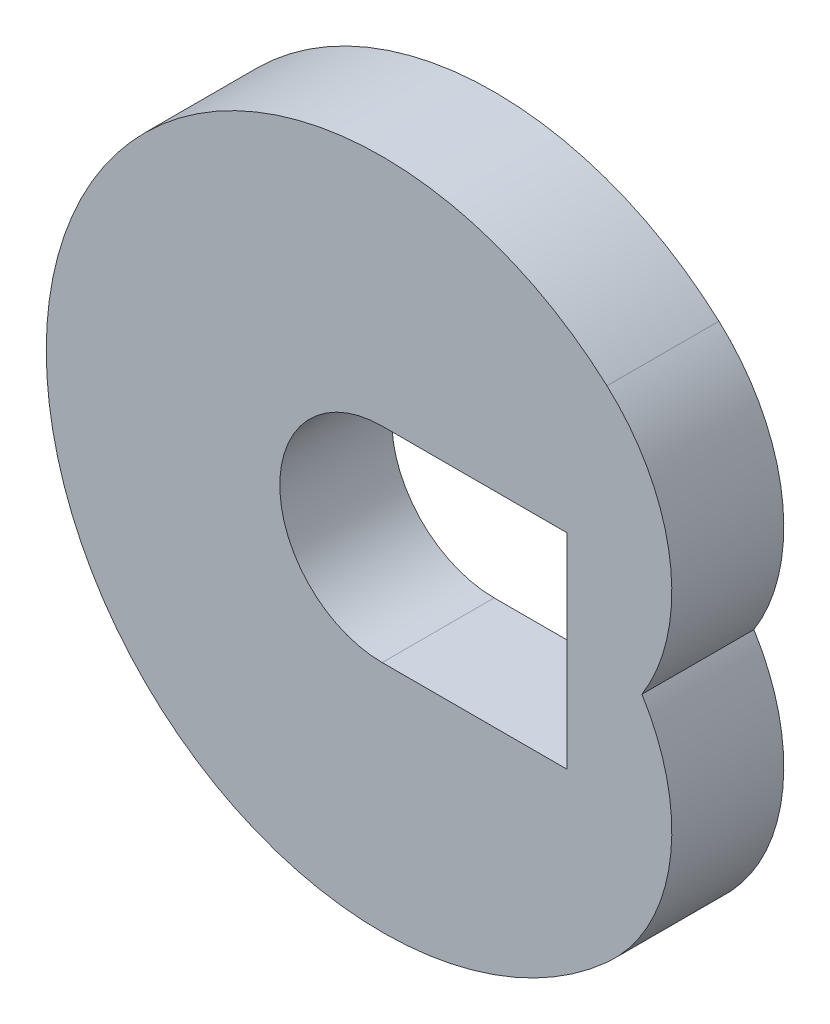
ISO-10303-21;
HEADER;
FILE_DESCRIPTION(('STEP AP214'),'2;1');
FILE_NAME('part.step','',(''),(''),'','','');
FILE_SCHEMA(('AUTOMOTIVE_DESIGN { 1 0 10303 214 1 1 1 1 }'));
ENDSEC;
DATA;
#1=APPLICATION_CONTEXT('core data for automotive mechanical design processes');
#2=APPLICATION_PROTOCOL_DEFINITION('international standard','automotive_design',2000,#1);
#3=PRODUCT_CONTEXT('',#1,'mechanical');
#4=PRODUCT('Part','Part','',(#3));
#5=PRODUCT_RELATED_PRODUCT_CATEGORY('part','',(#4));
#6=PRODUCT_DEFINITION_FORMATION('','',#4);
#7=PRODUCT_DEFINITION_CONTEXT('part definition',#1,'design');
#8=PRODUCT_DEFINITION('design','',#6,#7);
#9=PRODUCT_DEFINITION_SHAPE('','',#8);
#10=(LENGTH_UNIT() NAMED_UNIT(*) SI_UNIT(.MILLI.,.METRE.));
#11=(NAMED_UNIT(*) PLANE_ANGLE_UNIT() SI_UNIT($,.RADIAN.));
#12=(NAMED_UNIT(*) SI_UNIT($,.STERADIAN.) SOLID_ANGLE_UNIT());
#13=UNCERTAINTY_MEASURE_WITH_UNIT(LENGTH_MEASURE(1.E-05),#10,'distance_accuracy_value','');
#14=(GEOMETRIC_REPRESENTATION_CONTEXT(3) GLOBAL_UNCERTAINTY_ASSIGNED_CONTEXT((#13)) GLOBAL_UNIT_ASSIGNED_CONTEXT((#10,
#11,#12)) REPRESENTATION_CONTEXT('',''));
#15=CARTESIAN_POINT('',(0.,0.,0.));
#16=DIRECTION('',(0.,0.,1.));
#17=DIRECTION('',(1.,0.,0.));
#18=AXIS2_PLACEMENT_3D('',#15,#16,#17);
#19=CARTESIAN_POINT('',(167.282651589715,0.,200.));
#20=DIRECTION('',(0.,0.,-1.));
#21=DIRECTION('',(-1.,0.,0.));
#22=AXIS2_PLACEMENT_3D('',#19,#20,#21);
#23=PLANE('',#22);
#24=CARTESIAN_POINT('',(167.282651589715,185.786206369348,200.));
#25=DIRECTION('',(0.,0.,-1.));
#26=DIRECTION('',(-1.,0.,0.));
#27=AXIS2_PLACEMENT_3D('',#24,#25,#26);
#28=CIRCLE('',#27,350.);
#29=CARTESIAN_POINT('',(401.478363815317,445.886895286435,200.));
#30=VERTEX_POINT('',#29);
#31=CARTESIAN_POINT('',(463.902754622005,1.11022302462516E-13,200.));
#32=VERTEX_POINT('',#31);
#33=EDGE_CURVE('E154',#30,#32,#28,.T.);
#34=ORIENTED_EDGE('',*,*,#33,.F.);
#35=CARTESIAN_POINT('',(0.,0.,200.));
#36=DIRECTION('',(0.,0.,1.));
#37=DIRECTION('',(1.,0.,0.));
#38=AXIS2_PLACEMENT_3D('',#35,#36,#37);
#39=CIRCLE('',#38,600.);
#40=CARTESIAN_POINT('',(401.478363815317,-445.886895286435,200.));
#41=VERTEX_POINT('',#40);
#42=EDGE_CURVE('E160',#30,#41,#39,.T.);
#43=ORIENTED_EDGE('',*,*,#42,.T.);
#44=CARTESIAN_POINT('',(167.282651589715,-185.786206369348,200.));
#45=DIRECTION('',(0.,0.,1.));
#46=DIRECTION('',(1.,0.,0.));
#47=AXIS2_PLACEMENT_3D('',#44,#45,#46);
#48=CIRCLE('',#47,350.);
#49=EDGE_CURVE('E157',#41,#32,#48,.T.);
#50=ORIENTED_EDGE('',*,*,#49,.T.);
#51=EDGE_LOOP('',(#34,#43,#50));
#52=FACE_BOUND('',#51,.T.);
#53=CARTESIAN_POINT('',(0.,0.,200.));
#54=DIRECTION('',(0.,0.,1.));
#55=DIRECTION('',(1.,0.,0.));
#56=AXIS2_PLACEMENT_3D('',#53,#54,#55);
#57=CIRCLE('',#56,182.881257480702);
#58=CARTESIAN_POINT('',(0.,182.881257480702,200.));
#59=VERTEX_POINT('',#58);
#60=CARTESIAN_POINT('',(0.,-182.881257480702,200.));
#61=VERTEX_POINT('',#60);
#62=EDGE_CURVE('E117',#59,#61,#57,.T.);
#63=ORIENTED_EDGE('',*,*,#62,.F.);
#64=DIRECTION('',(1.,0.,0.));
#65=VECTOR('',#64,1.);
#66=CARTESIAN_POINT('',(0.,182.881257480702,200.));
#67=LINE('',#66,#65);
#68=CARTESIAN_POINT('',(330.,182.881257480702,200.));
#69=VERTEX_POINT('',#68);
#70=EDGE_CURVE('E139',#59,#69,#67,.T.);
#71=ORIENTED_EDGE('',*,*,#70,.T.);
#72=DIRECTION('',(0.,-1.,0.));
#73=VECTOR('',#72,1.);
#74=CARTESIAN_POINT('',(330.,182.881257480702,200.));
#75=LINE('',#74,#73);
#76=CARTESIAN_POINT('',(330.,-182.881257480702,200.));
#77=VERTEX_POINT('',#76);
#78=EDGE_CURVE('E76',#69,#77,#75,.T.);
#79=ORIENTED_EDGE('',*,*,#78,.T.);
#80=DIRECTION('',(-1.,0.,0.));
#81=VECTOR('',#80,1.);
#82=CARTESIAN_POINT('',(330.,-182.881257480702,200.));
#83=LINE('',#82,#81);
#84=EDGE_CURVE('E127',#77,#61,#83,.T.);
#85=ORIENTED_EDGE('',*,*,#84,.T.);
#86=EDGE_LOOP('',(#63,#71,#79,#85));
#87=FACE_BOUND('',#86,.T.);
#88=ADVANCED_FACE('F59',(#52,#87),#23,.F.);
#89=CARTESIAN_POINT('',(167.282651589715,0.,0.));
#90=DIRECTION('',(0.,0.,-1.));
#91=DIRECTION('',(-1.,0.,0.));
#92=AXIS2_PLACEMENT_3D('',#89,#90,#91);
#93=PLANE('',#92);
#94=CARTESIAN_POINT('',(167.282651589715,185.786206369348,0.));
#95=DIRECTION('',(0.,0.,-1.));
#96=DIRECTION('',(-1.,0.,0.));
#97=AXIS2_PLACEMENT_3D('',#94,#95,#96);
#98=CIRCLE('',#97,350.);
#99=CARTESIAN_POINT('',(401.478363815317,445.886895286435,0.));
#100=VERTEX_POINT('',#99);
#101=CARTESIAN_POINT('',(463.902754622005,1.11022302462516E-13,0.));
#102=VERTEX_POINT('',#101);
#103=EDGE_CURVE('E135',#100,#102,#98,.T.);
#104=ORIENTED_EDGE('',*,*,#103,.T.);
#105=CARTESIAN_POINT('',(167.282651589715,-185.786206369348,0.));
#106=DIRECTION('',(0.,0.,1.));
#107=DIRECTION('',(1.,0.,0.));
#108=AXIS2_PLACEMENT_3D('',#105,#106,#107);
#109=CIRCLE('',#108,350.);
#110=CARTESIAN_POINT('',(401.478363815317,-445.886895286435,0.));
#111=VERTEX_POINT('',#110);
#112=EDGE_CURVE('E164',#111,#102,#109,.T.);
#113=ORIENTED_EDGE('',*,*,#112,.F.);
#114=CARTESIAN_POINT('',(0.,0.,0.));
#115=DIRECTION('',(0.,0.,1.));
#116=DIRECTION('',(1.,0.,0.));
#117=AXIS2_PLACEMENT_3D('',#114,#115,#116);
#118=CIRCLE('',#117,600.);
#119=EDGE_CURVE('E158',#100,#111,#118,.T.);
#120=ORIENTED_EDGE('',*,*,#119,.F.);
#121=EDGE_LOOP('',(#104,#113,#120));
#122=FACE_BOUND('',#121,.T.);
#123=DIRECTION('',(1.,0.,0.));
#124=VECTOR('',#123,1.);
#125=CARTESIAN_POINT('',(0.,182.881257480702,0.));
#126=LINE('',#125,#124);
#127=CARTESIAN_POINT('',(0.,182.881257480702,0.));
#128=VERTEX_POINT('',#127);
#129=CARTESIAN_POINT('',(330.,182.881257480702,0.));
#130=VERTEX_POINT('',#129);
#131=EDGE_CURVE('E128',#128,#130,#126,.T.);
#132=ORIENTED_EDGE('',*,*,#131,.F.);
#133=CARTESIAN_POINT('',(0.,0.,0.));
#134=DIRECTION('',(0.,0.,1.));
#135=DIRECTION('',(1.,0.,0.));
#136=AXIS2_PLACEMENT_3D('',#133,#134,#135);
#137=CIRCLE('',#136,182.881257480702);
#138=CARTESIAN_POINT('',(0.,-182.881257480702,0.));
#139=VERTEX_POINT('',#138);
#140=EDGE_CURVE('E84',#128,#139,#137,.T.);
#141=ORIENTED_EDGE('',*,*,#140,.T.);
#142=DIRECTION('',(-1.,0.,0.));
#143=VECTOR('',#142,1.);
#144=CARTESIAN_POINT('',(330.,-182.881257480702,0.));
#145=LINE('',#144,#143);
#146=CARTESIAN_POINT('',(330.,-182.881257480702,0.));
#147=VERTEX_POINT('',#146);
#148=EDGE_CURVE('E134',#147,#139,#145,.T.);
#149=ORIENTED_EDGE('',*,*,#148,.F.);
#150=DIRECTION('',(0.,-1.,0.));
#151=VECTOR('',#150,1.);
#152=CARTESIAN_POINT('',(330.,182.881257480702,0.));
#153=LINE('',#152,#151);
#154=EDGE_CURVE('E145',#130,#147,#153,.T.);
#155=ORIENTED_EDGE('',*,*,#154,.F.);
#156=EDGE_LOOP('',(#132,#141,#149,#155));
#157=FACE_BOUND('',#156,.T.);
#158=ADVANCED_FACE('F179',(#122,#157),#93,.T.);
#159=CARTESIAN_POINT('',(167.282651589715,185.786206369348,200.));
#160=DIRECTION('',(0.,0.,-1.));
#161=DIRECTION('',(-1.,0.,0.));
#162=AXIS2_PLACEMENT_3D('',#159,#160,#161);
#163=CYLINDRICAL_SURFACE('',#162,350.);
#164=ORIENTED_EDGE('',*,*,#103,.F.);
#165=DIRECTION('',(0.,0.,-1.));
#166=VECTOR('',#165,1.);
#167=CARTESIAN_POINT('',(401.478363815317,445.886895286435,200.));
#168=LINE('',#167,#166);
#169=EDGE_CURVE('E12',#30,#100,#168,.T.);
#170=ORIENTED_EDGE('',*,*,#169,.F.);
#171=ORIENTED_EDGE('',*,*,#33,.T.);
#172=DIRECTION('',(0.,0.,-1.));
#173=VECTOR('',#172,1.);
#174=CARTESIAN_POINT('',(463.902754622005,1.11022302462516E-13,200.));
#175=LINE('',#174,#173);
#176=EDGE_CURVE('E63',#32,#102,#175,.T.);
#177=ORIENTED_EDGE('',*,*,#176,.T.);
#178=EDGE_LOOP('',(#164,#170,#171,#177));
#179=FACE_BOUND('',#178,.T.);
#180=ADVANCED_FACE('F61',(#179),#163,.T.);
#181=CARTESIAN_POINT('',(0.,0.,200.));
#182=DIRECTION('',(0.,0.,-1.));
#183=DIRECTION('',(-1.,0.,0.));
#184=AXIS2_PLACEMENT_3D('',#181,#182,#183);
#185=CYLINDRICAL_SURFACE('',#184,600.);
#186=ORIENTED_EDGE('',*,*,#119,.T.);
#187=DIRECTION('',(0.,0.,-1.));
#188=VECTOR('',#187,1.);
#189=CARTESIAN_POINT('',(401.478363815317,-445.886895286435,200.));
#190=LINE('',#189,#188);
#191=EDGE_CURVE('E68',#41,#111,#190,.T.);
#192=ORIENTED_EDGE('',*,*,#191,.F.);
#193=ORIENTED_EDGE('',*,*,#42,.F.);
#194=ORIENTED_EDGE('',*,*,#169,.T.);
#195=EDGE_LOOP('',(#186,#192,#193,#194));
#196=FACE_BOUND('',#195,.T.);
#197=ADVANCED_FACE('F182',(#196),#185,.T.);
#198=CARTESIAN_POINT('',(167.282651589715,-185.786206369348,200.));
#199=DIRECTION('',(0.,0.,-1.));
#200=DIRECTION('',(-1.,0.,0.));
#201=AXIS2_PLACEMENT_3D('',#198,#199,#200);
#202=CYLINDRICAL_SURFACE('',#201,350.);
#203=ORIENTED_EDGE('',*,*,#112,.T.);
#204=ORIENTED_EDGE('',*,*,#176,.F.);
#205=ORIENTED_EDGE('',*,*,#49,.F.);
#206=ORIENTED_EDGE('',*,*,#191,.T.);
#207=EDGE_LOOP('',(#203,#204,#205,#206));
#208=FACE_BOUND('',#207,.T.);
#209=ADVANCED_FACE('F176',(#208),#202,.T.);
#210=CARTESIAN_POINT('',(0.,0.,200.));
#211=DIRECTION('',(0.,0.,-1.));
#212=DIRECTION('',(-1.,0.,0.));
#213=AXIS2_PLACEMENT_3D('',#210,#211,#212);
#214=CYLINDRICAL_SURFACE('',#213,182.881257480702);
#215=ORIENTED_EDGE('',*,*,#140,.F.);
#216=DIRECTION('',(0.,0.,-1.));
#217=VECTOR('',#216,1.);
#218=CARTESIAN_POINT('',(0.,182.881257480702,200.));
#219=LINE('',#218,#217);
#220=EDGE_CURVE('E122',#59,#128,#219,.T.);
#221=ORIENTED_EDGE('',*,*,#220,.F.);
#222=ORIENTED_EDGE('',*,*,#62,.T.);
#223=DIRECTION('',(0.,0.,-1.));
#224=VECTOR('',#223,1.);
#225=CARTESIAN_POINT('',(0.,-182.881257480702,200.));
#226=LINE('',#225,#224);
#227=EDGE_CURVE('E120',#61,#139,#226,.T.);
#228=ORIENTED_EDGE('',*,*,#227,.T.);
#229=EDGE_LOOP('',(#215,#221,#222,#228));
#230=FACE_BOUND('',#229,.T.);
#231=ADVANCED_FACE('F119',(#230),#214,.F.);
#232=CARTESIAN_POINT('',(330.,-182.881257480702,200.));
#233=DIRECTION('',(0.,-1.,0.));
#234=DIRECTION('',(1.,0.,0.));
#235=AXIS2_PLACEMENT_3D('',#232,#233,#234);
#236=PLANE('',#235);
#237=ORIENTED_EDGE('',*,*,#148,.T.);
#238=ORIENTED_EDGE('',*,*,#227,.F.);
#239=ORIENTED_EDGE('',*,*,#84,.F.);
#240=DIRECTION('',(0.,0.,-1.));
#241=VECTOR('',#240,1.);
#242=CARTESIAN_POINT('',(330.,-182.881257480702,200.));
#243=LINE('',#242,#241);
#244=EDGE_CURVE('E136',#77,#147,#243,.T.);
#245=ORIENTED_EDGE('',*,*,#244,.T.);
#246=EDGE_LOOP('',(#237,#238,#239,#245));
#247=FACE_BOUND('',#246,.T.);
#248=ADVANCED_FACE('F132',(#247),#236,.F.);
#249=CARTESIAN_POINT('',(330.,182.881257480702,200.));
#250=DIRECTION('',(1.,0.,0.));
#251=DIRECTION('',(0.,0.,-1.));
#252=AXIS2_PLACEMENT_3D('',#249,#250,#251);
#253=PLANE('',#252);
#254=ORIENTED_EDGE('',*,*,#154,.T.);
#255=ORIENTED_EDGE('',*,*,#244,.F.);
#256=ORIENTED_EDGE('',*,*,#78,.F.);
#257=DIRECTION('',(0.,0.,-1.));
#258=VECTOR('',#257,1.);
#259=CARTESIAN_POINT('',(330.,182.881257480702,200.));
#260=LINE('',#259,#258);
#261=EDGE_CURVE('E151',#69,#130,#260,.T.);
#262=ORIENTED_EDGE('',*,*,#261,.T.);
#263=EDGE_LOOP('',(#254,#255,#256,#262));
#264=FACE_BOUND('',#263,.T.);
#265=ADVANCED_FACE('F202',(#264),#253,.F.);
#266=CARTESIAN_POINT('',(0.,182.881257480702,200.));
#267=DIRECTION('',(0.,1.,0.));
#268=DIRECTION('',(-1.,0.,0.));
#269=AXIS2_PLACEMENT_3D('',#266,#267,#268);
#270=PLANE('',#269);
#271=ORIENTED_EDGE('',*,*,#131,.T.);
#272=ORIENTED_EDGE('',*,*,#261,.F.);
#273=ORIENTED_EDGE('',*,*,#70,.F.);
#274=ORIENTED_EDGE('',*,*,#220,.T.);
#275=EDGE_LOOP('',(#271,#272,#273,#274));
#276=FACE_BOUND('',#275,.T.);
#277=ADVANCED_FACE('F206',(#276),#270,.F.);
#278=CLOSED_SHELL('',(#88,#158,#180,#197,#209,#231,#248,#265,#277));
#279=MANIFOLD_SOLID_BREP('B2',#278);
#280=ADVANCED_BREP_SHAPE_REPRESENTATION('',(#18,#279),#14);
#281=SHAPE_DEFINITION_REPRESENTATION(#9,#280);
ENDSEC;
END-ISO-10303-21;
